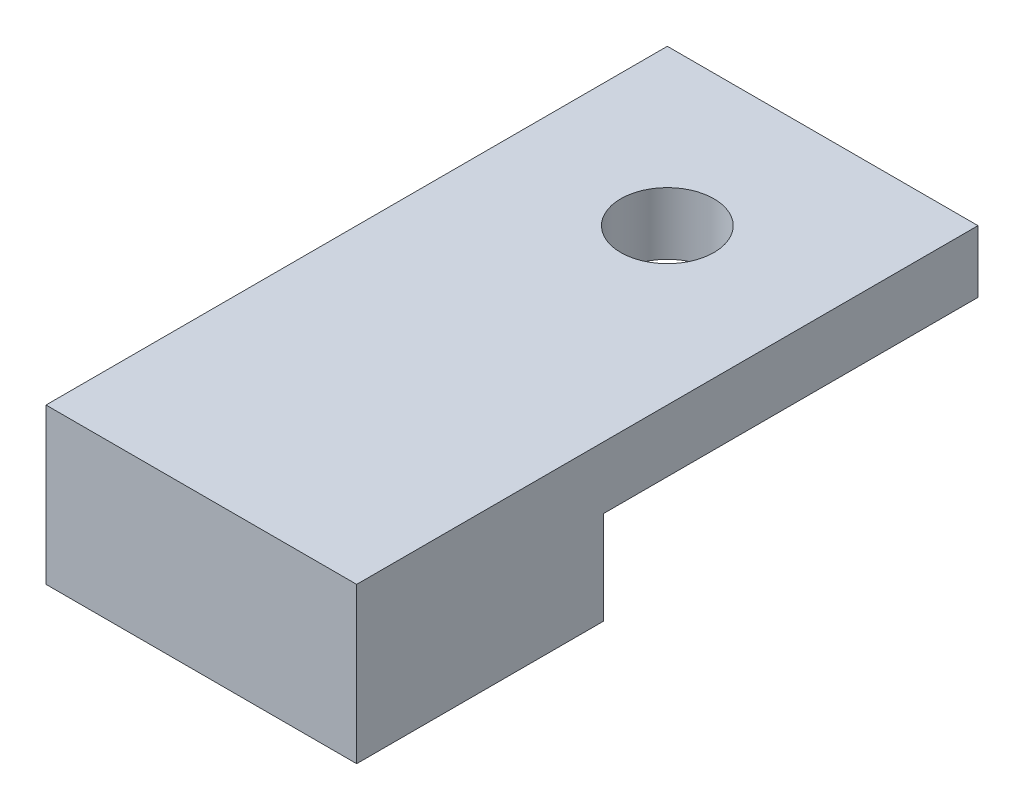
from build123d import *

# Parameters (mm, degrees)
BOSS_EXTRU_2_DEPTH      = 10
ESQUISSE4_R             = 1.5
ENL_V_MAT_EXTRU_2_DEPTH = 10


with BuildPart() as part:
    # Esquisse3 → Boss.-Extru.2 (new body)
    with BuildSketch(Plane(origin=(0, 0, 0), x_dir=(0, 0, -1), z_dir=(1, 0, 0))):
        Polygon((0, 0), (0, 5), (20, 5), (20, 3), (7.95, 3), (7.95, 0), align=None)
    extrude(amount=BOSS_EXTRU_2_DEPTH)

    # Esquisse4 → Enl_v. mat.-Extru.2 (cut)
    with BuildSketch(Plane(origin=(0, 5, 0), x_dir=(1, 0, 0), z_dir=(0, 1, 0))):
        with Locations(Location((5, 15, 0), (0, 0, 270))):
            Circle(ESQUISSE4_R)
    extrude(amount=-ENL_V_MAT_EXTRU_2_DEPTH, mode=Mode.SUBTRACT)


solid = part.part
